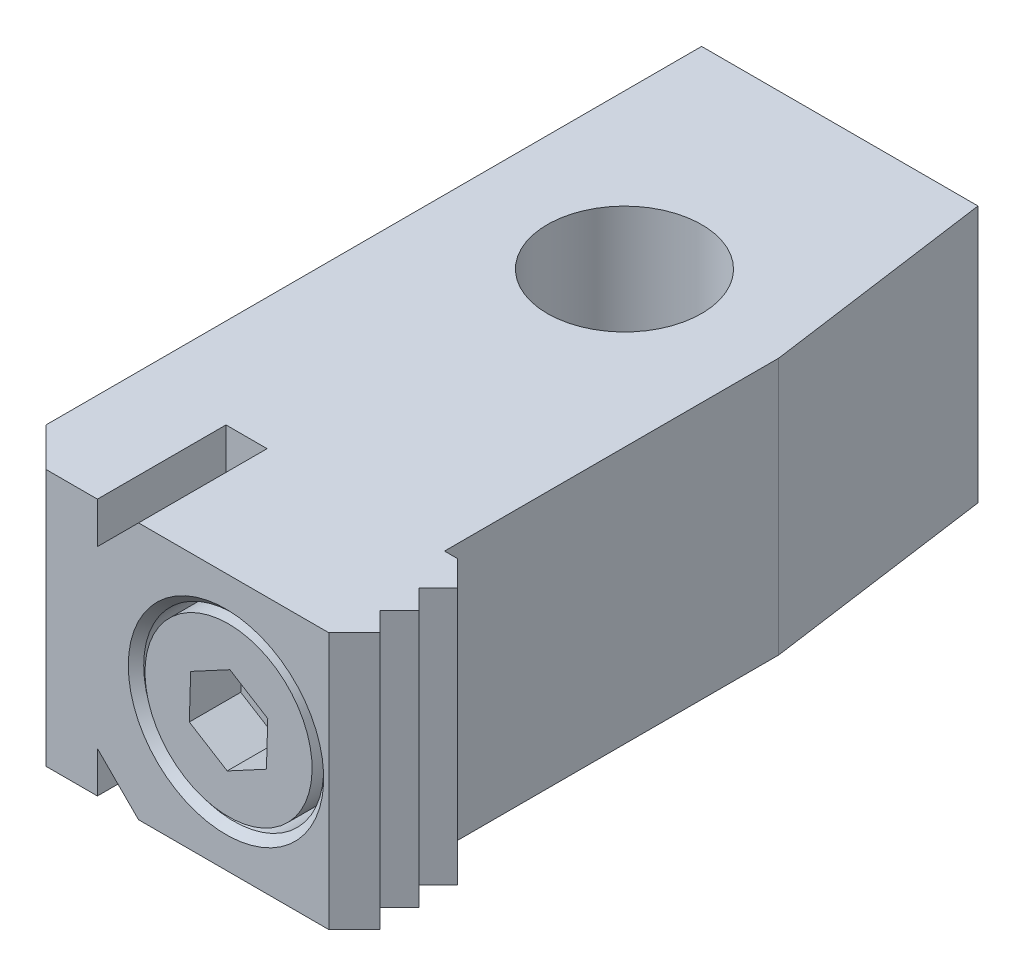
ISO-10303-21;
HEADER;
FILE_DESCRIPTION(('STEP AP214'),'2;1');
FILE_NAME('part.step','',(''),(''),'','','');
FILE_SCHEMA(('AUTOMOTIVE_DESIGN { 1 0 10303 214 1 1 1 1 }'));
ENDSEC;
DATA;
#1=APPLICATION_CONTEXT('core data for automotive mechanical design processes');
#2=APPLICATION_PROTOCOL_DEFINITION('international standard','automotive_design',2000,#1);
#3=PRODUCT_CONTEXT('',#1,'mechanical');
#4=PRODUCT('Part','Part','',(#3));
#5=PRODUCT_RELATED_PRODUCT_CATEGORY('part','',(#4));
#6=PRODUCT_DEFINITION_FORMATION('','',#4);
#7=PRODUCT_DEFINITION_CONTEXT('part definition',#1,'design');
#8=PRODUCT_DEFINITION('design','',#6,#7);
#9=PRODUCT_DEFINITION_SHAPE('','',#8);
#10=(LENGTH_UNIT() NAMED_UNIT(*) SI_UNIT(.MILLI.,.METRE.));
#11=(NAMED_UNIT(*) PLANE_ANGLE_UNIT() SI_UNIT($,.RADIAN.));
#12=(NAMED_UNIT(*) SI_UNIT($,.STERADIAN.) SOLID_ANGLE_UNIT());
#13=UNCERTAINTY_MEASURE_WITH_UNIT(LENGTH_MEASURE(1.E-05),#10,'distance_accuracy_value','');
#14=(GEOMETRIC_REPRESENTATION_CONTEXT(3) GLOBAL_UNCERTAINTY_ASSIGNED_CONTEXT((#13)) GLOBAL_UNIT_ASSIGNED_CONTEXT((#10,
#11,#12)) REPRESENTATION_CONTEXT('',''));
#15=CARTESIAN_POINT('',(0.,0.,0.));
#16=DIRECTION('',(0.,0.,1.));
#17=DIRECTION('',(1.,0.,0.));
#18=AXIS2_PLACEMENT_3D('',#15,#16,#17);
#19=CARTESIAN_POINT('',(-2.,0.,30.8));
#20=DIRECTION('',(0.,0.,-1.));
#21=DIRECTION('',(1.,0.,0.));
#22=AXIS2_PLACEMENT_3D('',#19,#20,#21);
#23=PLANE('',#22);
#24=CARTESIAN_POINT('',(5.,0.,30.8));
#25=DIRECTION('',(0.,0.,1.));
#26=DIRECTION('',(-1.,0.,0.));
#27=AXIS2_PLACEMENT_3D('',#24,#25,#26);
#28=CIRCLE('',#27,7.);
#29=CARTESIAN_POINT('',(-2.,0.,30.8));
#30=VERTEX_POINT('',#29);
#31=EDGE_CURVE('E209',#30,#30,#28,.T.);
#32=ORIENTED_EDGE('',*,*,#31,.T.);
#33=EDGE_LOOP('',(#32));
#34=FACE_BOUND('',#33,.T.);
#35=CARTESIAN_POINT('',(5.,0.,30.8));
#36=DIRECTION('',(0.,0.,-1.));
#37=DIRECTION('',(-0.999547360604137,0.0300844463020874,0.));
#38=AXIS2_PLACEMENT_3D('',#35,#36,#37);
#39=CIRCLE('',#38,6.5);
#40=CARTESIAN_POINT('',(-1.49705784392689,0.195548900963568,30.8));
#41=VERTEX_POINT('',#40);
#42=EDGE_CURVE('E803',#41,#41,#39,.T.);
#43=ORIENTED_EDGE('',*,*,#42,.T.);
#44=EDGE_LOOP('',(#43));
#45=FACE_BOUND('',#44,.T.);
#46=ADVANCED_FACE('F15',(#34,#45),#23,.F.);
#47=CARTESIAN_POINT('',(5.,0.,36.));
#48=DIRECTION('',(0.,0.,1.));
#49=DIRECTION('',(-1.,0.,0.));
#50=AXIS2_PLACEMENT_3D('',#47,#48,#49);
#51=CYLINDRICAL_SURFACE('',#50,7.);
#52=ORIENTED_EDGE('',*,*,#31,.F.);
#53=EDGE_LOOP('',(#52));
#54=FACE_BOUND('',#53,.T.);
#55=CARTESIAN_POINT('',(5.,0.,35.399999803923));
#56=DIRECTION('',(0.,0.,1.));
#57=DIRECTION('',(-1.,0.,0.));
#58=AXIS2_PLACEMENT_3D('',#55,#56,#57);
#59=CIRCLE('',#58,7.);
#60=CARTESIAN_POINT('',(-2.,0.,35.399999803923));
#61=VERTEX_POINT('',#60);
#62=EDGE_CURVE('E215',#61,#61,#59,.T.);
#63=ORIENTED_EDGE('',*,*,#62,.T.);
#64=EDGE_LOOP('',(#63));
#65=FACE_BOUND('',#64,.T.);
#66=ADVANCED_FACE('F565',(#54,#65),#51,.F.);
#67=CARTESIAN_POINT('',(5.,0.,36.));
#68=DIRECTION('',(0.,0.,1.));
#69=DIRECTION('',(-1.,0.,0.));
#70=AXIS2_PLACEMENT_3D('',#67,#68,#69);
#71=CONICAL_SURFACE('',#70,7.6,0.785398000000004);
#72=ORIENTED_EDGE('',*,*,#62,.F.);
#73=EDGE_LOOP('',(#72));
#74=FACE_BOUND('',#73,.T.);
#75=CARTESIAN_POINT('',(5.,0.,36.));
#76=DIRECTION('',(0.,0.,1.));
#77=DIRECTION('',(-1.,0.,0.));
#78=AXIS2_PLACEMENT_3D('',#75,#76,#77);
#79=CIRCLE('',#78,7.6);
#80=CARTESIAN_POINT('',(-2.6,0.,36.));
#81=VERTEX_POINT('',#80);
#82=EDGE_CURVE('E218',#81,#81,#79,.T.);
#83=ORIENTED_EDGE('',*,*,#82,.T.);
#84=EDGE_LOOP('',(#83));
#85=FACE_BOUND('',#84,.T.);
#86=ADVANCED_FACE('F440',(#74,#85),#71,.F.);
#87=CARTESIAN_POINT('',(15.,10.,36.));
#88=DIRECTION('',(0.,0.,1.));
#89=DIRECTION('',(-1.,0.,0.));
#90=AXIS2_PLACEMENT_3D('',#87,#88,#89);
#91=PLANE('',#90);
#92=ORIENTED_EDGE('',*,*,#82,.F.);
#93=EDGE_LOOP('',(#92));
#94=FACE_BOUND('',#93,.T.);
#95=DIRECTION('',(0.,1.,0.));
#96=VECTOR('',#95,1.);
#97=CARTESIAN_POINT('',(13.,-10.,36.));
#98=LINE('',#97,#96);
#99=CARTESIAN_POINT('',(13.,-10.,36.));
#100=VERTEX_POINT('',#99);
#101=CARTESIAN_POINT('',(13.,10.,36.));
#102=VERTEX_POINT('',#101);
#103=EDGE_CURVE('E256',#100,#102,#98,.T.);
#104=ORIENTED_EDGE('',*,*,#103,.T.);
#105=DIRECTION('',(-1.,0.,0.));
#106=VECTOR('',#105,1.);
#107=CARTESIAN_POINT('',(15.,10.,36.));
#108=LINE('',#107,#106);
#109=CARTESIAN_POINT('',(-1.8,10.,36.));
#110=VERTEX_POINT('',#109);
#111=EDGE_CURVE('E280',#102,#110,#108,.T.);
#112=ORIENTED_EDGE('',*,*,#111,.T.);
#113=DIRECTION('',(-0.707106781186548,-0.707106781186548,0.));
#114=VECTOR('',#113,1.);
#115=CARTESIAN_POINT('',(-5.,6.8,36.));
#116=LINE('',#115,#114);
#117=CARTESIAN_POINT('',(-5.,6.8,36.));
#118=VERTEX_POINT('',#117);
#119=EDGE_CURVE('E282',#110,#118,#116,.T.);
#120=ORIENTED_EDGE('',*,*,#119,.T.);
#121=DIRECTION('',(0.,-1.,0.));
#122=VECTOR('',#121,1.);
#123=CARTESIAN_POINT('',(-5.,-10.,36.));
#124=LINE('',#123,#122);
#125=CARTESIAN_POINT('',(-5.,10.,36.));
#126=VERTEX_POINT('',#125);
#127=EDGE_CURVE('E311',#126,#118,#124,.T.);
#128=ORIENTED_EDGE('',*,*,#127,.F.);
#129=DIRECTION('',(-1.,0.,0.));
#130=VECTOR('',#129,1.);
#131=CARTESIAN_POINT('',(12.,10.,36.));
#132=LINE('',#131,#130);
#133=CARTESIAN_POINT('',(-9.,10.,36.));
#134=VERTEX_POINT('',#133);
#135=EDGE_CURVE('E339',#126,#134,#132,.T.);
#136=ORIENTED_EDGE('',*,*,#135,.T.);
#137=DIRECTION('',(0.,-1.,0.));
#138=VECTOR('',#137,1.);
#139=CARTESIAN_POINT('',(-9.,-10.,36.));
#140=LINE('',#139,#138);
#141=CARTESIAN_POINT('',(-9.,-10.,36.));
#142=VERTEX_POINT('',#141);
#143=EDGE_CURVE('E155',#134,#142,#140,.T.);
#144=ORIENTED_EDGE('',*,*,#143,.T.);
#145=DIRECTION('',(-1.,0.,0.));
#146=VECTOR('',#145,1.);
#147=CARTESIAN_POINT('',(12.,-10.,36.));
#148=LINE('',#147,#146);
#149=CARTESIAN_POINT('',(-5.,-10.,36.));
#150=VERTEX_POINT('',#149);
#151=EDGE_CURVE('E194',#150,#142,#148,.T.);
#152=ORIENTED_EDGE('',*,*,#151,.F.);
#153=CARTESIAN_POINT('',(-5.,-6.8,36.));
#154=VERTEX_POINT('',#153);
#155=EDGE_CURVE('E182',#154,#150,#124,.T.);
#156=ORIENTED_EDGE('',*,*,#155,.F.);
#157=DIRECTION('',(0.707106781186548,-0.707106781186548,0.));
#158=VECTOR('',#157,1.);
#159=CARTESIAN_POINT('',(-1.8,-10.,36.));
#160=LINE('',#159,#158);
#161=CARTESIAN_POINT('',(-1.8,-10.,36.));
#162=VERTEX_POINT('',#161);
#163=EDGE_CURVE('E285',#154,#162,#160,.T.);
#164=ORIENTED_EDGE('',*,*,#163,.T.);
#165=DIRECTION('',(1.,0.,0.));
#166=VECTOR('',#165,1.);
#167=CARTESIAN_POINT('',(15.,-10.,36.));
#168=LINE('',#167,#166);
#169=EDGE_CURVE('E287',#162,#100,#168,.T.);
#170=ORIENTED_EDGE('',*,*,#169,.T.);
#171=EDGE_LOOP('',(#104,#112,#120,#128,#136,#144,#152,#156,#164,#170));
#172=FACE_BOUND('',#171,.T.);
#173=ADVANCED_FACE('F389',(#94,#172),#91,.T.);
#174=CARTESIAN_POINT('',(15.,-10.,34.));
#175=DIRECTION('',(-0.707106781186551,0.,-0.707106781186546));
#176=DIRECTION('',(0.707106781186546,0.,-0.707106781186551));
#177=AXIS2_PLACEMENT_3D('',#174,#175,#176);
#178=PLANE('',#177);
#179=DIRECTION('',(-0.707106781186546,0.,0.707106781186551));
#180=VECTOR('',#179,1.);
#181=CARTESIAN_POINT('',(15.,10.,34.));
#182=LINE('',#181,#180);
#183=CARTESIAN_POINT('',(15.,10.,34.));
#184=VERTEX_POINT('',#183);
#185=EDGE_CURVE('E236',#184,#102,#182,.T.);
#186=ORIENTED_EDGE('',*,*,#185,.T.);
#187=ORIENTED_EDGE('',*,*,#103,.F.);
#188=DIRECTION('',(-0.707106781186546,0.,0.707106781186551));
#189=VECTOR('',#188,1.);
#190=CARTESIAN_POINT('',(15.,-10.,34.));
#191=LINE('',#190,#189);
#192=CARTESIAN_POINT('',(15.,-10.,34.));
#193=VERTEX_POINT('',#192);
#194=EDGE_CURVE('E252',#193,#100,#191,.T.);
#195=ORIENTED_EDGE('',*,*,#194,.F.);
#196=DIRECTION('',(0.,1.,0.));
#197=VECTOR('',#196,1.);
#198=CARTESIAN_POINT('',(15.,-10.,34.));
#199=LINE('',#198,#197);
#200=EDGE_CURVE('E260',#193,#184,#199,.T.);
#201=ORIENTED_EDGE('',*,*,#200,.T.);
#202=EDGE_LOOP('',(#186,#187,#195,#201));
#203=FACE_BOUND('',#202,.T.);
#204=ADVANCED_FACE('F431',(#203),#178,.F.);
#205=CARTESIAN_POINT('',(15.,10.,36.));
#206=DIRECTION('',(0.,-1.,0.));
#207=DIRECTION('',(0.,0.,1.));
#208=AXIS2_PLACEMENT_3D('',#205,#206,#207);
#209=PLANE('',#208);
#210=ORIENTED_EDGE('',*,*,#111,.F.);
#211=ORIENTED_EDGE('',*,*,#185,.F.);
#212=DIRECTION('',(0.707106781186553,0.,0.707106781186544));
#213=VECTOR('',#212,1.);
#214=CARTESIAN_POINT('',(13.5,10.,32.5));
#215=LINE('',#214,#213);
#216=CARTESIAN_POINT('',(13.5,10.,32.5));
#217=VERTEX_POINT('',#216);
#218=EDGE_CURVE('E233',#217,#184,#215,.T.);
#219=ORIENTED_EDGE('',*,*,#218,.F.);
#220=DIRECTION('',(-0.707106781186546,0.,0.70710678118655));
#221=VECTOR('',#220,1.);
#222=CARTESIAN_POINT('',(15.,10.,31.));
#223=LINE('',#222,#221);
#224=CARTESIAN_POINT('',(15.,10.,31.));
#225=VERTEX_POINT('',#224);
#226=EDGE_CURVE('E230',#225,#217,#223,.T.);
#227=ORIENTED_EDGE('',*,*,#226,.F.);
#228=DIRECTION('',(0.707106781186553,0.,0.707106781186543));
#229=VECTOR('',#228,1.);
#230=CARTESIAN_POINT('',(13.5,10.,29.5));
#231=LINE('',#230,#229);
#232=CARTESIAN_POINT('',(13.5,10.,29.5));
#233=VERTEX_POINT('',#232);
#234=EDGE_CURVE('E227',#233,#225,#231,.T.);
#235=ORIENTED_EDGE('',*,*,#234,.F.);
#236=DIRECTION('',(-0.707106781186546,0.,0.70710678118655));
#237=VECTOR('',#236,1.);
#238=CARTESIAN_POINT('',(15.,10.,28.));
#239=LINE('',#238,#237);
#240=CARTESIAN_POINT('',(15.,10.,28.));
#241=VERTEX_POINT('',#240);
#242=EDGE_CURVE('E224',#241,#233,#239,.T.);
#243=ORIENTED_EDGE('',*,*,#242,.F.);
#244=DIRECTION('',(0.707106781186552,0.,0.707106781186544));
#245=VECTOR('',#244,1.);
#246=CARTESIAN_POINT('',(13.,10.,26.));
#247=LINE('',#246,#245);
#248=CARTESIAN_POINT('',(13.,10.,26.));
#249=VERTEX_POINT('',#248);
#250=EDGE_CURVE('E221',#249,#241,#247,.T.);
#251=ORIENTED_EDGE('',*,*,#250,.F.);
#252=DIRECTION('',(-1.,0.,0.));
#253=VECTOR('',#252,1.);
#254=CARTESIAN_POINT('',(15.,10.,26.));
#255=LINE('',#254,#253);
#256=CARTESIAN_POINT('',(12.,10.,26.));
#257=VERTEX_POINT('',#256);
#258=EDGE_CURVE('E259',#249,#257,#255,.T.);
#259=ORIENTED_EDGE('',*,*,#258,.T.);
#260=DIRECTION('',(0.,0.,1.));
#261=VECTOR('',#260,1.);
#262=CARTESIAN_POINT('',(12.,10.,-18.));
#263=LINE('',#262,#261);
#264=CARTESIAN_POINT('',(12.,10.,0.));
#265=VERTEX_POINT('',#264);
#266=EDGE_CURVE('E336',#265,#257,#263,.T.);
#267=ORIENTED_EDGE('',*,*,#266,.F.);
#268=DIRECTION('',(-0.137568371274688,0.,-0.990492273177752));
#269=VECTOR('',#268,1.);
#270=CARTESIAN_POINT('',(9.5,10.,-18.));
#271=LINE('',#270,#269);
#272=CARTESIAN_POINT('',(9.5,10.,-18.));
#273=VERTEX_POINT('',#272);
#274=EDGE_CURVE('E171',#265,#273,#271,.T.);
#275=ORIENTED_EDGE('',*,*,#274,.T.);
#276=DIRECTION('',(1.,0.,0.));
#277=VECTOR('',#276,1.);
#278=CARTESIAN_POINT('',(12.,10.,-18.));
#279=LINE('',#278,#277);
#280=CARTESIAN_POINT('',(-12.,10.,-18.));
#281=VERTEX_POINT('',#280);
#282=EDGE_CURVE('E181',#281,#273,#279,.T.);
#283=ORIENTED_EDGE('',*,*,#282,.F.);
#284=DIRECTION('',(0.,0.,-1.));
#285=VECTOR('',#284,1.);
#286=CARTESIAN_POINT('',(-12.,10.,-18.));
#287=LINE('',#286,#285);
#288=CARTESIAN_POINT('',(-12.,10.,33.));
#289=VERTEX_POINT('',#288);
#290=EDGE_CURVE('E341',#289,#281,#287,.T.);
#291=ORIENTED_EDGE('',*,*,#290,.F.);
#292=DIRECTION('',(-0.707106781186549,0.,-0.707106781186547));
#293=VECTOR('',#292,1.);
#294=CARTESIAN_POINT('',(-12.,10.,33.));
#295=LINE('',#294,#293);
#296=EDGE_CURVE('E200',#289,#134,#295,.F.);
#297=ORIENTED_EDGE('',*,*,#296,.T.);
#298=ORIENTED_EDGE('',*,*,#135,.F.);
#299=DIRECTION('',(0.,0.,1.));
#300=VECTOR('',#299,1.);
#301=CARTESIAN_POINT('',(-5.,10.,26.));
#302=LINE('',#301,#300);
#303=CARTESIAN_POINT('',(-5.,10.,26.));
#304=VERTEX_POINT('',#303);
#305=EDGE_CURVE('E325',#304,#126,#302,.T.);
#306=ORIENTED_EDGE('',*,*,#305,.F.);
#307=DIRECTION('',(-1.,0.,0.));
#308=VECTOR('',#307,1.);
#309=CARTESIAN_POINT('',(12.,10.,26.));
#310=LINE('',#309,#308);
#311=CARTESIAN_POINT('',(-1.8,10.,26.));
#312=VERTEX_POINT('',#311);
#313=EDGE_CURVE('E314',#312,#304,#310,.T.);
#314=ORIENTED_EDGE('',*,*,#313,.F.);
#315=DIRECTION('',(0.,0.,-1.));
#316=VECTOR('',#315,1.);
#317=CARTESIAN_POINT('',(-1.8,10.,36.));
#318=LINE('',#317,#316);
#319=EDGE_CURVE('E297',#110,#312,#318,.T.);
#320=ORIENTED_EDGE('',*,*,#319,.F.);
#321=EDGE_LOOP('',(#210,#211,#219,#227,#235,#243,#251,#259,#267,#275,#283,#291,#297,#298,#306,
#314,#320));
#322=FACE_BOUND('',#321,.T.);
#323=CARTESIAN_POINT('',(0.,10.,0.));
#324=DIRECTION('',(0.,-1.,0.));
#325=DIRECTION('',(0.,0.,1.));
#326=AXIS2_PLACEMENT_3D('',#323,#324,#325);
#327=CIRCLE('',#326,6.);
#328=CARTESIAN_POINT('',(0.,10.,6.));
#329=VERTEX_POINT('',#328);
#330=EDGE_CURVE('E329',#329,#329,#327,.T.);
#331=ORIENTED_EDGE('',*,*,#330,.T.);
#332=EDGE_LOOP('',(#331));
#333=FACE_BOUND('',#332,.T.);
#334=ADVANCED_FACE('F356',(#322,#333),#209,.F.);
#335=CARTESIAN_POINT('',(-5.,6.8,36.));
#336=DIRECTION('',(0.707106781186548,-0.707106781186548,0.));
#337=DIRECTION('',(0.707106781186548,0.707106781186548,0.));
#338=AXIS2_PLACEMENT_3D('',#335,#336,#337);
#339=PLANE('',#338);
#340=DIRECTION('',(-0.707106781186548,-0.707106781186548,0.));
#341=VECTOR('',#340,1.);
#342=CARTESIAN_POINT('',(-5.,6.8,26.));
#343=LINE('',#342,#341);
#344=CARTESIAN_POINT('',(-5.,6.8,26.));
#345=VERTEX_POINT('',#344);
#346=EDGE_CURVE('E273',#312,#345,#343,.T.);
#347=ORIENTED_EDGE('',*,*,#346,.T.);
#348=DIRECTION('',(0.,0.,-1.));
#349=VECTOR('',#348,1.);
#350=CARTESIAN_POINT('',(-5.,6.8,36.));
#351=LINE('',#350,#349);
#352=EDGE_CURVE('E295',#118,#345,#351,.T.);
#353=ORIENTED_EDGE('',*,*,#352,.F.);
#354=ORIENTED_EDGE('',*,*,#119,.F.);
#355=ORIENTED_EDGE('',*,*,#319,.T.);
#356=EDGE_LOOP('',(#347,#353,#354,#355));
#357=FACE_BOUND('',#356,.T.);
#358=ADVANCED_FACE('F428',(#357),#339,.F.);
#359=CARTESIAN_POINT('',(-1.8,-10.,36.));
#360=DIRECTION('',(0.707106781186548,0.707106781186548,0.));
#361=DIRECTION('',(-0.707106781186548,0.707106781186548,0.));
#362=AXIS2_PLACEMENT_3D('',#359,#360,#361);
#363=PLANE('',#362);
#364=DIRECTION('',(0.707106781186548,-0.707106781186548,0.));
#365=VECTOR('',#364,1.);
#366=CARTESIAN_POINT('',(-1.8,-10.,26.));
#367=LINE('',#366,#365);
#368=CARTESIAN_POINT('',(-5.,-6.8,26.));
#369=VERTEX_POINT('',#368);
#370=CARTESIAN_POINT('',(-1.8,-10.,26.));
#371=VERTEX_POINT('',#370);
#372=EDGE_CURVE('E276',#369,#371,#367,.T.);
#373=ORIENTED_EDGE('',*,*,#372,.T.);
#374=DIRECTION('',(0.,0.,-1.));
#375=VECTOR('',#374,1.);
#376=CARTESIAN_POINT('',(-1.8,-10.,36.));
#377=LINE('',#376,#375);
#378=EDGE_CURVE('E290',#162,#371,#377,.T.);
#379=ORIENTED_EDGE('',*,*,#378,.F.);
#380=ORIENTED_EDGE('',*,*,#163,.F.);
#381=DIRECTION('',(0.,0.,-1.));
#382=VECTOR('',#381,1.);
#383=CARTESIAN_POINT('',(-5.,-6.8,36.));
#384=LINE('',#383,#382);
#385=EDGE_CURVE('E293',#154,#369,#384,.T.);
#386=ORIENTED_EDGE('',*,*,#385,.T.);
#387=EDGE_LOOP('',(#373,#379,#380,#386));
#388=FACE_BOUND('',#387,.T.);
#389=ADVANCED_FACE('F393',(#388),#363,.F.);
#390=CARTESIAN_POINT('',(15.,-10.,36.));
#391=DIRECTION('',(0.,1.,0.));
#392=DIRECTION('',(0.,0.,-1.));
#393=AXIS2_PLACEMENT_3D('',#390,#391,#392);
#394=PLANE('',#393);
#395=DIRECTION('',(0.707106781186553,0.,0.707106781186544));
#396=VECTOR('',#395,1.);
#397=CARTESIAN_POINT('',(13.5,-10.,32.5));
#398=LINE('',#397,#396);
#399=CARTESIAN_POINT('',(13.5,-10.,32.5));
#400=VERTEX_POINT('',#399);
#401=EDGE_CURVE('E250',#400,#193,#398,.T.);
#402=ORIENTED_EDGE('',*,*,#401,.T.);
#403=ORIENTED_EDGE('',*,*,#194,.T.);
#404=ORIENTED_EDGE('',*,*,#169,.F.);
#405=ORIENTED_EDGE('',*,*,#378,.T.);
#406=DIRECTION('',(1.,0.,0.));
#407=VECTOR('',#406,1.);
#408=CARTESIAN_POINT('',(12.,-10.,26.));
#409=LINE('',#408,#407);
#410=CARTESIAN_POINT('',(-5.,-10.,26.));
#411=VERTEX_POINT('',#410);
#412=EDGE_CURVE('E322',#411,#371,#409,.T.);
#413=ORIENTED_EDGE('',*,*,#412,.F.);
#414=DIRECTION('',(0.,0.,1.));
#415=VECTOR('',#414,1.);
#416=CARTESIAN_POINT('',(-5.,-10.,26.));
#417=LINE('',#416,#415);
#418=EDGE_CURVE('E326',#411,#150,#417,.T.);
#419=ORIENTED_EDGE('',*,*,#418,.T.);
#420=ORIENTED_EDGE('',*,*,#151,.T.);
#421=DIRECTION('',(0.707106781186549,0.,0.707106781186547));
#422=VECTOR('',#421,1.);
#423=CARTESIAN_POINT('',(-25.5,-10.,19.5));
#424=LINE('',#423,#422);
#425=CARTESIAN_POINT('',(-12.,-10.,33.));
#426=VERTEX_POINT('',#425);
#427=EDGE_CURVE('E19',#142,#426,#424,.F.);
#428=ORIENTED_EDGE('',*,*,#427,.T.);
#429=DIRECTION('',(0.,0.,-1.));
#430=VECTOR('',#429,1.);
#431=CARTESIAN_POINT('',(-12.,-10.,-18.));
#432=LINE('',#431,#430);
#433=CARTESIAN_POINT('',(-12.,-10.,-18.));
#434=VERTEX_POINT('',#433);
#435=EDGE_CURVE('E188',#426,#434,#432,.T.);
#436=ORIENTED_EDGE('',*,*,#435,.T.);
#437=DIRECTION('',(1.,0.,0.));
#438=VECTOR('',#437,1.);
#439=CARTESIAN_POINT('',(12.,-10.,-18.));
#440=LINE('',#439,#438);
#441=CARTESIAN_POINT('',(9.5,-10.,-18.));
#442=VERTEX_POINT('',#441);
#443=EDGE_CURVE('E179',#434,#442,#440,.T.);
#444=ORIENTED_EDGE('',*,*,#443,.T.);
#445=DIRECTION('',(-0.137568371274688,0.,-0.990492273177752));
#446=VECTOR('',#445,1.);
#447=CARTESIAN_POINT('',(9.5,-10.,-18.));
#448=LINE('',#447,#446);
#449=CARTESIAN_POINT('',(12.,-10.,0.));
#450=VERTEX_POINT('',#449);
#451=EDGE_CURVE('E160',#450,#442,#448,.T.);
#452=ORIENTED_EDGE('',*,*,#451,.F.);
#453=DIRECTION('',(0.,0.,1.));
#454=VECTOR('',#453,1.);
#455=CARTESIAN_POINT('',(12.,-10.,-18.));
#456=LINE('',#455,#454);
#457=CARTESIAN_POINT('',(12.,-10.,26.));
#458=VERTEX_POINT('',#457);
#459=EDGE_CURVE('E344',#450,#458,#456,.T.);
#460=ORIENTED_EDGE('',*,*,#459,.T.);
#461=DIRECTION('',(1.,0.,0.));
#462=VECTOR('',#461,1.);
#463=CARTESIAN_POINT('',(15.,-10.,26.));
#464=LINE('',#463,#462);
#465=CARTESIAN_POINT('',(13.,-10.,26.));
#466=VERTEX_POINT('',#465);
#467=EDGE_CURVE('E278',#458,#466,#464,.T.);
#468=ORIENTED_EDGE('',*,*,#467,.T.);
#469=DIRECTION('',(0.707106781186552,0.,0.707106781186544));
#470=VECTOR('',#469,1.);
#471=CARTESIAN_POINT('',(13.,-10.,26.));
#472=LINE('',#471,#470);
#473=CARTESIAN_POINT('',(15.,-10.,28.));
#474=VERTEX_POINT('',#473);
#475=EDGE_CURVE('E238',#466,#474,#472,.T.);
#476=ORIENTED_EDGE('',*,*,#475,.T.);
#477=DIRECTION('',(-0.707106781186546,0.,0.70710678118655));
#478=VECTOR('',#477,1.);
#479=CARTESIAN_POINT('',(15.,-10.,28.));
#480=LINE('',#479,#478);
#481=CARTESIAN_POINT('',(13.5,-10.,29.5));
#482=VERTEX_POINT('',#481);
#483=EDGE_CURVE('E241',#474,#482,#480,.T.);
#484=ORIENTED_EDGE('',*,*,#483,.T.);
#485=DIRECTION('',(0.707106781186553,0.,0.707106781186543));
#486=VECTOR('',#485,1.);
#487=CARTESIAN_POINT('',(13.5,-10.,29.5));
#488=LINE('',#487,#486);
#489=CARTESIAN_POINT('',(15.,-10.,31.));
#490=VERTEX_POINT('',#489);
#491=EDGE_CURVE('E244',#482,#490,#488,.T.);
#492=ORIENTED_EDGE('',*,*,#491,.T.);
#493=DIRECTION('',(-0.707106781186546,0.,0.70710678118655));
#494=VECTOR('',#493,1.);
#495=CARTESIAN_POINT('',(15.,-10.,31.));
#496=LINE('',#495,#494);
#497=EDGE_CURVE('E247',#490,#400,#496,.T.);
#498=ORIENTED_EDGE('',*,*,#497,.T.);
#499=EDGE_LOOP('',(#402,#403,#404,#405,#413,#419,#420,#428,#436,#444,#452,#460,#468,#476,#484,
#492,#498));
#500=FACE_BOUND('',#499,.T.);
#501=CARTESIAN_POINT('',(0.,-10.,0.));
#502=DIRECTION('',(0.,-1.,0.));
#503=DIRECTION('',(0.,0.,1.));
#504=AXIS2_PLACEMENT_3D('',#501,#502,#503);
#505=CIRCLE('',#504,6.);
#506=CARTESIAN_POINT('',(0.,-10.,6.));
#507=VERTEX_POINT('',#506);
#508=EDGE_CURVE('E333',#507,#507,#505,.T.);
#509=ORIENTED_EDGE('',*,*,#508,.F.);
#510=EDGE_LOOP('',(#509));
#511=FACE_BOUND('',#510,.T.);
#512=ADVANCED_FACE('F185',(#500,#511),#394,.F.);
#513=CARTESIAN_POINT('',(13.5,-10.,32.5));
#514=DIRECTION('',(-0.707106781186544,0.,0.707106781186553));
#515=DIRECTION('',(-0.707106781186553,0.,-0.707106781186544));
#516=AXIS2_PLACEMENT_3D('',#513,#514,#515);
#517=PLANE('',#516);
#518=ORIENTED_EDGE('',*,*,#218,.T.);
#519=ORIENTED_EDGE('',*,*,#200,.F.);
#520=ORIENTED_EDGE('',*,*,#401,.F.);
#521=DIRECTION('',(0.,1.,0.));
#522=VECTOR('',#521,1.);
#523=CARTESIAN_POINT('',(13.5,-10.,32.5));
#524=LINE('',#523,#522);
#525=EDGE_CURVE('E262',#400,#217,#524,.T.);
#526=ORIENTED_EDGE('',*,*,#525,.T.);
#527=EDGE_LOOP('',(#518,#519,#520,#526));
#528=FACE_BOUND('',#527,.T.);
#529=ADVANCED_FACE('F385',(#528),#517,.F.);
#530=CARTESIAN_POINT('',(15.,-10.,31.));
#531=DIRECTION('',(-0.707106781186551,0.,-0.707106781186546));
#532=DIRECTION('',(0.707106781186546,0.,-0.707106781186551));
#533=AXIS2_PLACEMENT_3D('',#530,#531,#532);
#534=PLANE('',#533);
#535=ORIENTED_EDGE('',*,*,#226,.T.);
#536=ORIENTED_EDGE('',*,*,#525,.F.);
#537=ORIENTED_EDGE('',*,*,#497,.F.);
#538=DIRECTION('',(0.,1.,0.));
#539=VECTOR('',#538,1.);
#540=CARTESIAN_POINT('',(15.,-10.,31.));
#541=LINE('',#540,#539);
#542=EDGE_CURVE('E264',#490,#225,#541,.T.);
#543=ORIENTED_EDGE('',*,*,#542,.T.);
#544=EDGE_LOOP('',(#535,#536,#537,#543));
#545=FACE_BOUND('',#544,.T.);
#546=ADVANCED_FACE('F381',(#545),#534,.F.);
#547=CARTESIAN_POINT('',(13.5,-10.,29.5));
#548=DIRECTION('',(-0.707106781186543,0.,0.707106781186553));
#549=DIRECTION('',(-0.707106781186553,0.,-0.707106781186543));
#550=AXIS2_PLACEMENT_3D('',#547,#548,#549);
#551=PLANE('',#550);
#552=ORIENTED_EDGE('',*,*,#234,.T.);
#553=ORIENTED_EDGE('',*,*,#542,.F.);
#554=ORIENTED_EDGE('',*,*,#491,.F.);
#555=DIRECTION('',(0.,1.,0.));
#556=VECTOR('',#555,1.);
#557=CARTESIAN_POINT('',(13.5,-10.,29.5));
#558=LINE('',#557,#556);
#559=EDGE_CURVE('E266',#482,#233,#558,.T.);
#560=ORIENTED_EDGE('',*,*,#559,.T.);
#561=EDGE_LOOP('',(#552,#553,#554,#560));
#562=FACE_BOUND('',#561,.T.);
#563=ADVANCED_FACE('F379',(#562),#551,.F.);
#564=CARTESIAN_POINT('',(15.,-10.,28.));
#565=DIRECTION('',(-0.70710678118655,0.,-0.707106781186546));
#566=DIRECTION('',(0.707106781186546,0.,-0.70710678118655));
#567=AXIS2_PLACEMENT_3D('',#564,#565,#566);
#568=PLANE('',#567);
#569=ORIENTED_EDGE('',*,*,#242,.T.);
#570=ORIENTED_EDGE('',*,*,#559,.F.);
#571=ORIENTED_EDGE('',*,*,#483,.F.);
#572=DIRECTION('',(0.,1.,0.));
#573=VECTOR('',#572,1.);
#574=CARTESIAN_POINT('',(15.,-10.,28.));
#575=LINE('',#574,#573);
#576=EDGE_CURVE('E268',#474,#241,#575,.T.);
#577=ORIENTED_EDGE('',*,*,#576,.T.);
#578=EDGE_LOOP('',(#569,#570,#571,#577));
#579=FACE_BOUND('',#578,.T.);
#580=ADVANCED_FACE('F374',(#579),#568,.F.);
#581=CARTESIAN_POINT('',(13.,-10.,26.));
#582=DIRECTION('',(-0.707106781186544,0.,0.707106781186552));
#583=DIRECTION('',(-0.707106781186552,0.,-0.707106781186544));
#584=AXIS2_PLACEMENT_3D('',#581,#582,#583);
#585=PLANE('',#584);
#586=ORIENTED_EDGE('',*,*,#250,.T.);
#587=ORIENTED_EDGE('',*,*,#576,.F.);
#588=ORIENTED_EDGE('',*,*,#475,.F.);
#589=DIRECTION('',(0.,1.,0.));
#590=VECTOR('',#589,1.);
#591=CARTESIAN_POINT('',(13.,-10.,26.));
#592=LINE('',#591,#590);
#593=EDGE_CURVE('E255',#466,#249,#592,.T.);
#594=ORIENTED_EDGE('',*,*,#593,.T.);
#595=EDGE_LOOP('',(#586,#587,#588,#594));
#596=FACE_BOUND('',#595,.T.);
#597=ADVANCED_FACE('F369',(#596),#585,.F.);
#598=CARTESIAN_POINT('',(15.,10.,26.));
#599=DIRECTION('',(0.,0.,1.));
#600=DIRECTION('',(-1.,0.,0.));
#601=AXIS2_PLACEMENT_3D('',#598,#599,#600);
#602=PLANE('',#601);
#603=ORIENTED_EDGE('',*,*,#467,.F.);
#604=DIRECTION('',(0.,1.,0.));
#605=VECTOR('',#604,1.);
#606=CARTESIAN_POINT('',(12.,-10.,26.));
#607=LINE('',#606,#605);
#608=EDGE_CURVE('E300',#458,#257,#607,.T.);
#609=ORIENTED_EDGE('',*,*,#608,.T.);
#610=ORIENTED_EDGE('',*,*,#258,.F.);
#611=ORIENTED_EDGE('',*,*,#593,.F.);
#612=EDGE_LOOP('',(#603,#609,#610,#611));
#613=FACE_BOUND('',#612,.T.);
#614=ADVANCED_FACE('F365',(#613),#602,.F.);
#615=CARTESIAN_POINT('',(12.,-10.,26.));
#616=DIRECTION('',(0.,0.,1.));
#617=DIRECTION('',(-1.,0.,0.));
#618=AXIS2_PLACEMENT_3D('',#615,#616,#617);
#619=PLANE('',#618);
#620=ORIENTED_EDGE('',*,*,#346,.F.);
#621=ORIENTED_EDGE('',*,*,#313,.T.);
#622=DIRECTION('',(0.,-1.,0.));
#623=VECTOR('',#622,1.);
#624=CARTESIAN_POINT('',(-5.,-10.,26.));
#625=LINE('',#624,#623);
#626=EDGE_CURVE('E319',#304,#345,#625,.T.);
#627=ORIENTED_EDGE('',*,*,#626,.T.);
#628=EDGE_LOOP('',(#620,#621,#627));
#629=FACE_BOUND('',#628,.T.);
#630=ADVANCED_FACE('F410',(#629),#619,.T.);
#631=CARTESIAN_POINT('',(-5.,-10.,26.));
#632=DIRECTION('',(-1.,0.,0.));
#633=DIRECTION('',(0.,-1.,0.));
#634=AXIS2_PLACEMENT_3D('',#631,#632,#633);
#635=PLANE('',#634);
#636=ORIENTED_EDGE('',*,*,#127,.T.);
#637=ORIENTED_EDGE('',*,*,#352,.T.);
#638=ORIENTED_EDGE('',*,*,#626,.F.);
#639=ORIENTED_EDGE('',*,*,#305,.T.);
#640=EDGE_LOOP('',(#636,#637,#638,#639));
#641=FACE_BOUND('',#640,.T.);
#642=ADVANCED_FACE('F402',(#641),#635,.F.);
#643=CARTESIAN_POINT('',(-12.,-10.,33.));
#644=DIRECTION('',(0.707106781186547,0.,-0.707106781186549));
#645=DIRECTION('',(0.707106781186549,0.,0.707106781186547));
#646=AXIS2_PLACEMENT_3D('',#643,#644,#645);
#647=PLANE('',#646);
#648=ORIENTED_EDGE('',*,*,#427,.F.);
#649=ORIENTED_EDGE('',*,*,#143,.F.);
#650=ORIENTED_EDGE('',*,*,#296,.F.);
#651=DIRECTION('',(0.,1.,0.));
#652=VECTOR('',#651,1.);
#653=CARTESIAN_POINT('',(-12.,-10.,33.));
#654=LINE('',#653,#652);
#655=EDGE_CURVE('E192',#426,#289,#654,.T.);
#656=ORIENTED_EDGE('',*,*,#655,.F.);
#657=EDGE_LOOP('',(#648,#649,#650,#656));
#658=FACE_BOUND('',#657,.T.);
#659=ADVANCED_FACE('F350',(#658),#647,.F.);
#660=EDGE_CURVE('E318',#369,#411,#625,.T.);
#661=ORIENTED_EDGE('',*,*,#660,.F.);
#662=ORIENTED_EDGE('',*,*,#385,.F.);
#663=ORIENTED_EDGE('',*,*,#155,.T.);
#664=ORIENTED_EDGE('',*,*,#418,.F.);
#665=EDGE_LOOP('',(#661,#662,#663,#664));
#666=FACE_BOUND('',#665,.T.);
#667=ADVANCED_FACE('F399',(#666),#635,.F.);
#668=ORIENTED_EDGE('',*,*,#372,.F.);
#669=ORIENTED_EDGE('',*,*,#660,.T.);
#670=ORIENTED_EDGE('',*,*,#412,.T.);
#671=EDGE_LOOP('',(#668,#669,#670));
#672=FACE_BOUND('',#671,.T.);
#673=ADVANCED_FACE('F396',(#672),#619,.T.);
#674=CARTESIAN_POINT('',(12.,-10.,-18.));
#675=DIRECTION('',(-1.,0.,0.));
#676=DIRECTION('',(0.,0.,-1.));
#677=AXIS2_PLACEMENT_3D('',#674,#675,#676);
#678=PLANE('',#677);
#679=ORIENTED_EDGE('',*,*,#459,.F.);
#680=DIRECTION('',(0.,-1.,0.));
#681=VECTOR('',#680,1.);
#682=CARTESIAN_POINT('',(12.,10.,0.));
#683=LINE('',#682,#681);
#684=EDGE_CURVE('E166',#265,#450,#683,.T.);
#685=ORIENTED_EDGE('',*,*,#684,.F.);
#686=ORIENTED_EDGE('',*,*,#266,.T.);
#687=ORIENTED_EDGE('',*,*,#608,.F.);
#688=EDGE_LOOP('',(#679,#685,#686,#687));
#689=FACE_BOUND('',#688,.T.);
#690=ADVANCED_FACE('F17',(#689),#678,.F.);
#691=CARTESIAN_POINT('',(9.5,10.,-18.));
#692=DIRECTION('',(-0.990492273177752,0.,0.137568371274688));
#693=DIRECTION('',(-0.137568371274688,0.,-0.990492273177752));
#694=AXIS2_PLACEMENT_3D('',#691,#692,#693);
#695=PLANE('',#694);
#696=ORIENTED_EDGE('',*,*,#451,.T.);
#697=DIRECTION('',(0.,-1.,0.));
#698=VECTOR('',#697,1.);
#699=CARTESIAN_POINT('',(9.5,10.,-18.));
#700=LINE('',#699,#698);
#701=EDGE_CURVE('E163',#273,#442,#700,.T.);
#702=ORIENTED_EDGE('',*,*,#701,.F.);
#703=ORIENTED_EDGE('',*,*,#274,.F.);
#704=ORIENTED_EDGE('',*,*,#684,.T.);
#705=EDGE_LOOP('',(#696,#702,#703,#704));
#706=FACE_BOUND('',#705,.T.);
#707=ADVANCED_FACE('F162',(#706),#695,.F.);
#708=CARTESIAN_POINT('',(12.,-10.,-18.));
#709=DIRECTION('',(0.,0.,1.));
#710=DIRECTION('',(-1.,0.,0.));
#711=AXIS2_PLACEMENT_3D('',#708,#709,#710);
#712=PLANE('',#711);
#713=ORIENTED_EDGE('',*,*,#282,.T.);
#714=ORIENTED_EDGE('',*,*,#701,.T.);
#715=ORIENTED_EDGE('',*,*,#443,.F.);
#716=DIRECTION('',(0.,1.,0.));
#717=VECTOR('',#716,1.);
#718=CARTESIAN_POINT('',(-12.,-10.,-18.));
#719=LINE('',#718,#717);
#720=EDGE_CURVE('E190',#434,#281,#719,.T.);
#721=ORIENTED_EDGE('',*,*,#720,.T.);
#722=EDGE_LOOP('',(#713,#714,#715,#721));
#723=FACE_BOUND('',#722,.T.);
#724=ADVANCED_FACE('F177',(#723),#712,.F.);
#725=CARTESIAN_POINT('',(-12.,-10.,-18.));
#726=DIRECTION('',(1.,0.,0.));
#727=DIRECTION('',(0.,0.,1.));
#728=AXIS2_PLACEMENT_3D('',#725,#726,#727);
#729=PLANE('',#728);
#730=ORIENTED_EDGE('',*,*,#435,.F.);
#731=ORIENTED_EDGE('',*,*,#655,.T.);
#732=ORIENTED_EDGE('',*,*,#290,.T.);
#733=ORIENTED_EDGE('',*,*,#720,.F.);
#734=EDGE_LOOP('',(#730,#731,#732,#733));
#735=FACE_BOUND('',#734,.T.);
#736=ADVANCED_FACE('F353',(#735),#729,.F.);
#737=CARTESIAN_POINT('',(0.,-10.,0.));
#738=DIRECTION('',(0.,1.,0.));
#739=DIRECTION('',(0.,0.,-1.));
#740=AXIS2_PLACEMENT_3D('',#737,#738,#739);
#741=CYLINDRICAL_SURFACE('',#740,6.);
#742=ORIENTED_EDGE('',*,*,#508,.T.);
#743=EDGE_LOOP('',(#742));
#744=FACE_BOUND('',#743,.T.);
#745=ORIENTED_EDGE('',*,*,#330,.F.);
#746=EDGE_LOOP('',(#745));
#747=FACE_BOUND('',#746,.T.);
#748=ADVANCED_FACE('F413',(#744,#747),#741,.F.);
#749=CARTESIAN_POINT('',(5.,0.,35.8));
#750=DIRECTION('',(0.,0.,1.));
#751=DIRECTION('',(0.999547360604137,-0.0300844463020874,0.));
#752=AXIS2_PLACEMENT_3D('',#749,#750,#751);
#753=PLANE('',#752);
#754=CARTESIAN_POINT('',(5.,0.,35.8));
#755=DIRECTION('',(0.,0.,1.));
#756=DIRECTION('',(0.999547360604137,-0.0300844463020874,0.));
#757=AXIS2_PLACEMENT_3D('',#754,#755,#756);
#758=CIRCLE('',#757,6.5);
#759=CARTESIAN_POINT('',(11.4970578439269,-0.195548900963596,35.8));
#760=VERTEX_POINT('',#759);
#761=EDGE_CURVE('E858',#760,#760,#758,.T.);
#762=ORIENTED_EDGE('',*,*,#761,.T.);
#763=EDGE_LOOP('',(#762));
#764=FACE_BOUND('',#763,.T.);
#765=DIRECTION('',(-0.880675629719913,-0.473719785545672,0.));
#766=VECTOR('',#765,1.);
#767=CARTESIAN_POINT('',(5.10421557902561,3.46253362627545,35.8));
#768=LINE('',#767,#766);
#769=CARTESIAN_POINT('',(5.10421557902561,3.46253362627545,35.8));
#770=VERTEX_POINT('',#769);
#771=CARTESIAN_POINT('',(2.05346570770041,1.82152015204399,35.8));
#772=VERTEX_POINT('',#771);
#773=EDGE_CURVE('E808',#770,#772,#768,.T.);
#774=ORIENTED_EDGE('',*,*,#773,.F.);
#775=DIRECTION('',(0.850591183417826,-0.525827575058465,0.));
#776=VECTOR('',#775,1.);
#777=CARTESIAN_POINT('',(5.10421557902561,3.46253362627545,35.8));
#778=LINE('',#777,#776);
#779=CARTESIAN_POINT('',(8.05074987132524,1.64101347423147,35.8));
#780=VERTEX_POINT('',#779);
#781=EDGE_CURVE('E35',#770,#780,#778,.T.);
#782=ORIENTED_EDGE('',*,*,#781,.T.);
#783=DIRECTION('',(0.0300844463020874,0.999547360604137,0.));
#784=VECTOR('',#783,1.);
#785=CARTESIAN_POINT('',(7.94653429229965,-1.82152015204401,35.8));
#786=LINE('',#785,#784);
#787=CARTESIAN_POINT('',(7.94653429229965,-1.82152015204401,35.8));
#788=VERTEX_POINT('',#787);
#789=EDGE_CURVE('E821',#788,#780,#786,.T.);
#790=ORIENTED_EDGE('',*,*,#789,.F.);
#791=DIRECTION('',(0.880675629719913,0.473719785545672,0.));
#792=VECTOR('',#791,1.);
#793=CARTESIAN_POINT('',(4.89578442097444,-3.46253362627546,35.8));
#794=LINE('',#793,#792);
#795=CARTESIAN_POINT('',(4.89578442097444,-3.46253362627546,35.8));
#796=VERTEX_POINT('',#795);
#797=EDGE_CURVE('E818',#796,#788,#794,.T.);
#798=ORIENTED_EDGE('',*,*,#797,.F.);
#799=DIRECTION('',(-0.850591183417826,0.525827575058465,0.));
#800=VECTOR('',#799,1.);
#801=CARTESIAN_POINT('',(4.89578442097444,-3.46253362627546,35.8));
#802=LINE('',#801,#800);
#803=CARTESIAN_POINT('',(1.94925012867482,-1.64101347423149,35.8));
#804=VERTEX_POINT('',#803);
#805=EDGE_CURVE('E815',#796,#804,#802,.T.);
#806=ORIENTED_EDGE('',*,*,#805,.T.);
#807=DIRECTION('',(-0.0300844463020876,-0.999547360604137,0.));
#808=VECTOR('',#807,1.);
#809=CARTESIAN_POINT('',(2.05346570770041,1.82152015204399,35.8));
#810=LINE('',#809,#808);
#811=EDGE_CURVE('E812',#772,#804,#810,.T.);
#812=ORIENTED_EDGE('',*,*,#811,.F.);
#813=EDGE_LOOP('',(#774,#782,#790,#798,#806,#812));
#814=FACE_BOUND('',#813,.T.);
#815=ADVANCED_FACE('F500',(#764,#814),#753,.T.);
#816=CARTESIAN_POINT('',(2.15768128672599,5.28405377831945,31.8));
#817=DIRECTION('',(0.,0.,-1.));
#818=DIRECTION('',(-0.999547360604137,0.0300844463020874,0.));
#819=AXIS2_PLACEMENT_3D('',#816,#817,#818);
#820=PLANE('',#819);
#821=DIRECTION('',(0.850591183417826,-0.525827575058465,0.));
#822=VECTOR('',#821,1.);
#823=CARTESIAN_POINT('',(5.10421557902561,3.46253362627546,31.8));
#824=LINE('',#823,#822);
#825=CARTESIAN_POINT('',(5.10421557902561,3.46253362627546,31.8));
#826=VERTEX_POINT('',#825);
#827=CARTESIAN_POINT('',(8.05074987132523,1.64101347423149,31.8));
#828=VERTEX_POINT('',#827);
#829=EDGE_CURVE('E811',#826,#828,#824,.T.);
#830=ORIENTED_EDGE('',*,*,#829,.F.);
#831=DIRECTION('',(-0.880675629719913,-0.473719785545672,0.));
#832=VECTOR('',#831,1.);
#833=CARTESIAN_POINT('',(5.10421557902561,3.46253362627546,31.8));
#834=LINE('',#833,#832);
#835=CARTESIAN_POINT('',(2.05346570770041,1.82152015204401,31.8));
#836=VERTEX_POINT('',#835);
#837=EDGE_CURVE('E825',#826,#836,#834,.T.);
#838=ORIENTED_EDGE('',*,*,#837,.T.);
#839=DIRECTION('',(-0.0300844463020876,-0.999547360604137,0.));
#840=VECTOR('',#839,1.);
#841=CARTESIAN_POINT('',(2.05346570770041,1.82152015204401,31.8));
#842=LINE('',#841,#840);
#843=CARTESIAN_POINT('',(1.94925012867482,-1.64101347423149,31.8));
#844=VERTEX_POINT('',#843);
#845=EDGE_CURVE('E829',#836,#844,#842,.T.);
#846=ORIENTED_EDGE('',*,*,#845,.T.);
#847=DIRECTION('',(-0.850591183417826,0.525827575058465,0.));
#848=VECTOR('',#847,1.);
#849=CARTESIAN_POINT('',(4.89578442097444,-3.46253362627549,31.8));
#850=LINE('',#849,#848);
#851=CARTESIAN_POINT('',(4.89578442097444,-3.46253362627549,31.8));
#852=VERTEX_POINT('',#851);
#853=EDGE_CURVE('E832',#852,#844,#850,.T.);
#854=ORIENTED_EDGE('',*,*,#853,.F.);
#855=DIRECTION('',(0.880675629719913,0.473719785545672,0.));
#856=VECTOR('',#855,1.);
#857=CARTESIAN_POINT('',(4.89578442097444,-3.46253362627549,31.8));
#858=LINE('',#857,#856);
#859=CARTESIAN_POINT('',(7.94653429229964,-1.82152015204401,31.8));
#860=VERTEX_POINT('',#859);
#861=EDGE_CURVE('E835',#852,#860,#858,.T.);
#862=ORIENTED_EDGE('',*,*,#861,.T.);
#863=DIRECTION('',(0.0300844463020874,0.999547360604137,0.));
#864=VECTOR('',#863,1.);
#865=CARTESIAN_POINT('',(7.94653429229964,-1.82152015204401,31.8));
#866=LINE('',#865,#864);
#867=EDGE_CURVE('E838',#860,#828,#866,.T.);
#868=ORIENTED_EDGE('',*,*,#867,.T.);
#869=EDGE_LOOP('',(#830,#838,#846,#854,#862,#868));
#870=FACE_BOUND('',#869,.T.);
#871=ADVANCED_FACE('F506',(#870),#820,.F.);
#872=CARTESIAN_POINT('',(5.10421557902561,3.46253362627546,31.8));
#873=DIRECTION('',(-0.473719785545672,0.880675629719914,0.));
#874=DIRECTION('',(-0.880675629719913,-0.473719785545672,0.));
#875=AXIS2_PLACEMENT_3D('',#872,#873,#874);
#876=PLANE('',#875);
#877=ORIENTED_EDGE('',*,*,#837,.F.);
#878=DIRECTION('',(0.,0.,1.));
#879=VECTOR('',#878,1.);
#880=CARTESIAN_POINT('',(5.10421557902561,3.46253362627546,31.8));
#881=LINE('',#880,#879);
#882=EDGE_CURVE('E828',#826,#770,#881,.T.);
#883=ORIENTED_EDGE('',*,*,#882,.T.);
#884=ORIENTED_EDGE('',*,*,#773,.T.);
#885=DIRECTION('',(0.,0.,1.));
#886=VECTOR('',#885,1.);
#887=CARTESIAN_POINT('',(2.05346570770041,1.82152015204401,31.8));
#888=LINE('',#887,#886);
#889=EDGE_CURVE('E844',#836,#772,#888,.T.);
#890=ORIENTED_EDGE('',*,*,#889,.F.);
#891=EDGE_LOOP('',(#877,#883,#884,#890));
#892=FACE_BOUND('',#891,.T.);
#893=ADVANCED_FACE('F509',(#892),#876,.F.);
#894=CARTESIAN_POINT('',(2.05346570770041,1.82152015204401,31.8));
#895=DIRECTION('',(-0.999547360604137,0.0300844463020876,0.));
#896=DIRECTION('',(-0.0300844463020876,-0.999547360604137,0.));
#897=AXIS2_PLACEMENT_3D('',#894,#895,#896);
#898=PLANE('',#897);
#899=ORIENTED_EDGE('',*,*,#889,.T.);
#900=ORIENTED_EDGE('',*,*,#811,.T.);
#901=DIRECTION('',(0.,0.,1.));
#902=VECTOR('',#901,1.);
#903=CARTESIAN_POINT('',(1.94925012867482,-1.64101347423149,31.8));
#904=LINE('',#903,#902);
#905=EDGE_CURVE('E847',#844,#804,#904,.T.);
#906=ORIENTED_EDGE('',*,*,#905,.F.);
#907=ORIENTED_EDGE('',*,*,#845,.F.);
#908=EDGE_LOOP('',(#899,#900,#906,#907));
#909=FACE_BOUND('',#908,.T.);
#910=ADVANCED_FACE('F519',(#909),#898,.F.);
#911=CARTESIAN_POINT('',(4.89578442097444,-3.46253362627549,31.8));
#912=DIRECTION('',(0.525827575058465,0.850591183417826,0.));
#913=DIRECTION('',(-0.850591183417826,0.525827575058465,0.));
#914=AXIS2_PLACEMENT_3D('',#911,#912,#913);
#915=PLANE('',#914);
#916=ORIENTED_EDGE('',*,*,#905,.T.);
#917=ORIENTED_EDGE('',*,*,#805,.F.);
#918=DIRECTION('',(0.,0.,1.));
#919=VECTOR('',#918,1.);
#920=CARTESIAN_POINT('',(4.89578442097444,-3.46253362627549,31.8));
#921=LINE('',#920,#919);
#922=EDGE_CURVE('E850',#852,#796,#921,.T.);
#923=ORIENTED_EDGE('',*,*,#922,.F.);
#924=ORIENTED_EDGE('',*,*,#853,.T.);
#925=EDGE_LOOP('',(#916,#917,#923,#924));
#926=FACE_BOUND('',#925,.T.);
#927=ADVANCED_FACE('F531',(#926),#915,.T.);
#928=CARTESIAN_POINT('',(4.89578442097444,-3.46253362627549,31.8));
#929=DIRECTION('',(0.473719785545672,-0.880675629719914,0.));
#930=DIRECTION('',(0.880675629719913,0.473719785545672,0.));
#931=AXIS2_PLACEMENT_3D('',#928,#929,#930);
#932=PLANE('',#931);
#933=ORIENTED_EDGE('',*,*,#922,.T.);
#934=ORIENTED_EDGE('',*,*,#797,.T.);
#935=DIRECTION('',(0.,0.,1.));
#936=VECTOR('',#935,1.);
#937=CARTESIAN_POINT('',(7.94653429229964,-1.82152015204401,31.8));
#938=LINE('',#937,#936);
#939=EDGE_CURVE('E853',#860,#788,#938,.T.);
#940=ORIENTED_EDGE('',*,*,#939,.F.);
#941=ORIENTED_EDGE('',*,*,#861,.F.);
#942=EDGE_LOOP('',(#933,#934,#940,#941));
#943=FACE_BOUND('',#942,.T.);
#944=ADVANCED_FACE('F540',(#943),#932,.F.);
#945=CARTESIAN_POINT('',(7.94653429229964,-1.82152015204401,31.8));
#946=DIRECTION('',(0.999547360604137,-0.0300844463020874,0.));
#947=DIRECTION('',(0.,0.,-1.));
#948=AXIS2_PLACEMENT_3D('',#945,#946,#947);
#949=PLANE('',#948);
#950=ORIENTED_EDGE('',*,*,#939,.T.);
#951=ORIENTED_EDGE('',*,*,#789,.T.);
#952=DIRECTION('',(0.,0.,1.));
#953=VECTOR('',#952,1.);
#954=CARTESIAN_POINT('',(8.05074987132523,1.64101347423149,31.8));
#955=LINE('',#954,#953);
#956=EDGE_CURVE('E856',#828,#780,#955,.T.);
#957=ORIENTED_EDGE('',*,*,#956,.F.);
#958=ORIENTED_EDGE('',*,*,#867,.F.);
#959=EDGE_LOOP('',(#950,#951,#957,#958));
#960=FACE_BOUND('',#959,.T.);
#961=ADVANCED_FACE('F544',(#960),#949,.F.);
#962=CARTESIAN_POINT('',(5.10421557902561,3.46253362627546,31.8));
#963=DIRECTION('',(-0.525827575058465,-0.850591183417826,0.));
#964=DIRECTION('',(0.850591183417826,-0.525827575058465,0.));
#965=AXIS2_PLACEMENT_3D('',#962,#963,#964);
#966=PLANE('',#965);
#967=ORIENTED_EDGE('',*,*,#956,.T.);
#968=ORIENTED_EDGE('',*,*,#781,.F.);
#969=ORIENTED_EDGE('',*,*,#882,.F.);
#970=ORIENTED_EDGE('',*,*,#829,.T.);
#971=EDGE_LOOP('',(#967,#968,#969,#970));
#972=FACE_BOUND('',#971,.T.);
#973=ADVANCED_FACE('F536',(#972),#966,.T.);
#974=CARTESIAN_POINT('',(5.,0.,32.8));
#975=DIRECTION('',(0.,0.,1.));
#976=DIRECTION('',(0.999547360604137,-0.0300844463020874,0.));
#977=AXIS2_PLACEMENT_3D('',#974,#975,#976);
#978=CYLINDRICAL_SURFACE('',#977,6.5);
#979=ORIENTED_EDGE('',*,*,#761,.F.);
#980=EDGE_LOOP('',(#979));
#981=FACE_BOUND('',#980,.T.);
#982=ORIENTED_EDGE('',*,*,#42,.F.);
#983=EDGE_LOOP('',(#982));
#984=FACE_BOUND('',#983,.T.);
#985=ADVANCED_FACE('F554',(#981,#984),#978,.T.);
#986=CLOSED_SHELL('',(#46,#66,#86,#173,#204,#334,#358,#389,#512,#529,#546,#563,#580,#597,#614,
#630,#642,#659,#667,#673,#690,#707,#724,#736,#748,#815,#871,#893,#910,#927,#944,#961,#973,#985));
#987=CARTESIAN_POINT('',(5.,0.,26.));
#988=DIRECTION('',(0.,0.,1.));
#989=DIRECTION('',(-1.,0.,0.));
#990=AXIS2_PLACEMENT_3D('',#987,#988,#989);
#991=CIRCLE('',#990,4.);
#992=CARTESIAN_POINT('',(1.,0.,26.));
#993=VERTEX_POINT('',#992);
#994=EDGE_CURVE('E9',#993,#993,#991,.F.);
#995=ORIENTED_EDGE('',*,*,#994,.T.);
#996=EDGE_LOOP('',(#995));
#997=FACE_BOUND('',#996,.T.);
#998=CARTESIAN_POINT('',(5.,0.,26.));
#999=DIRECTION('',(0.,0.,1.));
#1000=DIRECTION('',(-1.,0.,0.));
#1001=AXIS2_PLACEMENT_3D('',#998,#999,#1000);
#1002=CIRCLE('',#1001,5.1);
#1003=CARTESIAN_POINT('',(-0.1,0.,26.));
#1004=VERTEX_POINT('',#1003);
#1005=EDGE_CURVE('E201',#1004,#1004,#1002,.T.);
#1006=ORIENTED_EDGE('',*,*,#1005,.T.);
#1007=EDGE_LOOP('',(#1006));
#1008=FACE_BOUND('',#1007,.T.);
#1009=ADVANCED_FACE('F411',(#997,#1008),#619,.T.);
#1010=CARTESIAN_POINT('',(5.,0.,36.));
#1011=DIRECTION('',(0.,0.,1.));
#1012=DIRECTION('',(-1.,0.,0.));
#1013=AXIS2_PLACEMENT_3D('',#1010,#1011,#1012);
#1014=CYLINDRICAL_SURFACE('',#1013,4.5);
#1015=CARTESIAN_POINT('',(5.,0.,26.6000001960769));
#1016=DIRECTION('',(0.,0.,1.));
#1017=DIRECTION('',(-1.,0.,0.));
#1018=AXIS2_PLACEMENT_3D('',#1015,#1016,#1017);
#1019=CIRCLE('',#1018,4.5);
#1020=CARTESIAN_POINT('',(0.5,0.,26.6000001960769));
#1021=VERTEX_POINT('',#1020);
#1022=EDGE_CURVE('E204',#1021,#1021,#1019,.T.);
#1023=ORIENTED_EDGE('',*,*,#1022,.F.);
#1024=EDGE_LOOP('',(#1023));
#1025=FACE_BOUND('',#1024,.T.);
#1026=CARTESIAN_POINT('',(5.,0.,30.8));
#1027=DIRECTION('',(0.,0.,-1.));
#1028=DIRECTION('',(1.,0.,0.));
#1029=AXIS2_PLACEMENT_3D('',#1026,#1027,#1028);
#1030=CIRCLE('',#1029,4.5);
#1031=CARTESIAN_POINT('',(9.5,0.,30.8));
#1032=VERTEX_POINT('',#1031);
#1033=EDGE_CURVE('E26',#1032,#1032,#1030,.T.);
#1034=ORIENTED_EDGE('',*,*,#1033,.F.);
#1035=EDGE_LOOP('',(#1034));
#1036=FACE_BOUND('',#1035,.T.);
#1037=ADVANCED_FACE('F576',(#1025,#1036),#1014,.F.);
#1038=CARTESIAN_POINT('',(5.,0.,26.6000001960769));
#1039=DIRECTION('',(0.,0.,-1.));
#1040=DIRECTION('',(1.,0.,0.));
#1041=AXIS2_PLACEMENT_3D('',#1038,#1039,#1040);
#1042=CONICAL_SURFACE('',#1041,4.5,0.785398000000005);
#1043=ORIENTED_EDGE('',*,*,#1005,.F.);
#1044=EDGE_LOOP('',(#1043));
#1045=FACE_BOUND('',#1044,.T.);
#1046=ORIENTED_EDGE('',*,*,#1022,.T.);
#1047=EDGE_LOOP('',(#1046));
#1048=FACE_BOUND('',#1047,.T.);
#1049=ADVANCED_FACE('F775',(#1045,#1048),#1042,.F.);
#1050=CARTESIAN_POINT('',(5.,0.,30.8));
#1051=DIRECTION('',(0.,0.,-1.));
#1052=DIRECTION('',(-0.999547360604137,0.0300844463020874,0.));
#1053=AXIS2_PLACEMENT_3D('',#1050,#1051,#1052);
#1054=PLANE('',#1053);
#1055=CARTESIAN_POINT('',(5.,0.,30.8));
#1056=DIRECTION('',(0.,0.,-1.));
#1057=DIRECTION('',(-0.999547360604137,0.0300844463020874,0.));
#1058=AXIS2_PLACEMENT_3D('',#1055,#1056,#1057);
#1059=CIRCLE('',#1058,4.);
#1060=CARTESIAN_POINT('',(1.00181055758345,0.12033778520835,30.8));
#1061=VERTEX_POINT('',#1060);
#1062=EDGE_CURVE('E800',#1061,#1061,#1059,.T.);
#1063=ORIENTED_EDGE('',*,*,#1062,.F.);
#1064=EDGE_LOOP('',(#1063));
#1065=FACE_BOUND('',#1064,.T.);
#1066=ORIENTED_EDGE('',*,*,#1033,.T.);
#1067=EDGE_LOOP('',(#1066));
#1068=FACE_BOUND('',#1067,.T.);
#1069=ADVANCED_FACE('F551',(#1065,#1068),#1054,.T.);
#1070=CARTESIAN_POINT('',(5.,0.,32.8));
#1071=DIRECTION('',(0.,0.,1.));
#1072=DIRECTION('',(0.999547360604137,-0.0300844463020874,0.));
#1073=AXIS2_PLACEMENT_3D('',#1070,#1071,#1072);
#1074=CYLINDRICAL_SURFACE('',#1073,4.);
#1075=ORIENTED_EDGE('',*,*,#994,.F.);
#1076=EDGE_LOOP('',(#1075));
#1077=FACE_BOUND('',#1076,.T.);
#1078=ORIENTED_EDGE('',*,*,#1062,.T.);
#1079=EDGE_LOOP('',(#1078));
#1080=FACE_BOUND('',#1079,.T.);
#1081=ADVANCED_FACE('F549',(#1077,#1080),#1074,.T.);
#1082=CLOSED_SHELL('',(#1009,#1037,#1049,#1069,#1081));
#1083=CARTESIAN_POINT('',(5.,0.,18.8));
#1084=DIRECTION('',(0.,0.,-1.));
#1085=DIRECTION('',(-0.999547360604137,0.0300844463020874,0.));
#1086=AXIS2_PLACEMENT_3D('',#1083,#1084,#1085);
#1087=PLANE('',#1086);
#1088=CARTESIAN_POINT('',(5.,0.,18.8));
#1089=DIRECTION('',(0.,0.,-1.));
#1090=DIRECTION('',(-0.999547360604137,0.0300844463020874,0.));
#1091=AXIS2_PLACEMENT_3D('',#1088,#1089,#1090);
#1092=CIRCLE('',#1091,4.);
#1093=CARTESIAN_POINT('',(1.00181055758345,0.120337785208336,18.8));
#1094=VERTEX_POINT('',#1093);
#1095=EDGE_CURVE('E316',#1094,#1094,#1092,.T.);
#1096=ORIENTED_EDGE('',*,*,#1095,.T.);
#1097=EDGE_LOOP('',(#1096));
#1098=FACE_BOUND('',#1097,.T.);
#1099=ADVANCED_FACE('F473',(#1098),#1087,.T.);
#1100=CARTESIAN_POINT('',(5.,0.,9.));
#1101=DIRECTION('',(0.,0.,-1.));
#1102=DIRECTION('',(1.,0.,0.));
#1103=AXIS2_PLACEMENT_3D('',#1100,#1101,#1102);
#1104=PLANE('',#1103);
#1105=CARTESIAN_POINT('',(5.,0.,9.));
#1106=DIRECTION('',(0.,0.,1.));
#1107=DIRECTION('',(-1.,0.,0.));
#1108=AXIS2_PLACEMENT_3D('',#1105,#1106,#1107);
#1109=CIRCLE('',#1108,2.5);
#1110=CARTESIAN_POINT('',(2.5,0.,9.));
#1111=VERTEX_POINT('',#1110);
#1112=EDGE_CURVE('E304',#1111,#1111,#1109,.T.);
#1113=ORIENTED_EDGE('',*,*,#1112,.T.);
#1114=EDGE_LOOP('',(#1113));
#1115=FACE_BOUND('',#1114,.T.);
#1116=ADVANCED_FACE('F472',(#1115),#1104,.F.);
#1117=CARTESIAN_POINT('',(5.,0.,26.));
#1118=DIRECTION('',(0.,0.,1.));
#1119=DIRECTION('',(-1.,0.,0.));
#1120=AXIS2_PLACEMENT_3D('',#1117,#1118,#1119);
#1121=CYLINDRICAL_SURFACE('',#1120,2.5);
#1122=ORIENTED_EDGE('',*,*,#1112,.F.);
#1123=EDGE_LOOP('',(#1122));
#1124=FACE_BOUND('',#1123,.T.);
#1125=CARTESIAN_POINT('',(5.,0.,14.));
#1126=DIRECTION('',(0.,0.,1.));
#1127=DIRECTION('',(-1.,0.,0.));
#1128=AXIS2_PLACEMENT_3D('',#1125,#1126,#1127);
#1129=CIRCLE('',#1128,2.5);
#1130=CARTESIAN_POINT('',(2.5,0.,14.));
#1131=VERTEX_POINT('',#1130);
#1132=EDGE_CURVE('E172',#1131,#1131,#1129,.T.);
#1133=ORIENTED_EDGE('',*,*,#1132,.T.);
#1134=EDGE_LOOP('',(#1133));
#1135=FACE_BOUND('',#1134,.T.);
#1136=ADVANCED_FACE('F477',(#1124,#1135),#1121,.F.);
#1137=CARTESIAN_POINT('',(2.5,0.,14.));
#1138=DIRECTION('',(0.,0.,-1.));
#1139=DIRECTION('',(1.,0.,0.));
#1140=AXIS2_PLACEMENT_3D('',#1137,#1138,#1139);
#1141=PLANE('',#1140);
#1142=ORIENTED_EDGE('',*,*,#1132,.F.);
#1143=EDGE_LOOP('',(#1142));
#1144=FACE_BOUND('',#1143,.T.);
#1145=CARTESIAN_POINT('',(5.,0.,14.));
#1146=DIRECTION('',(0.,0.,-1.));
#1147=DIRECTION('',(1.,0.,0.));
#1148=AXIS2_PLACEMENT_3D('',#1145,#1146,#1147);
#1149=CIRCLE('',#1148,4.);
#1150=CARTESIAN_POINT('',(9.,0.,14.));
#1151=VERTEX_POINT('',#1150);
#1152=EDGE_CURVE('E301',#1151,#1151,#1149,.F.);
#1153=ORIENTED_EDGE('',*,*,#1152,.T.);
#1154=EDGE_LOOP('',(#1153));
#1155=FACE_BOUND('',#1154,.T.);
#1156=ADVANCED_FACE('F469',(#1144,#1155),#1141,.F.);
#1157=CARTESIAN_POINT('',(5.,0.,2.68629150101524));
#1158=DIRECTION('',(0.,0.,1.));
#1159=DIRECTION('',(-1.,0.,0.));
#1160=AXIS2_PLACEMENT_3D('',#1157,#1158,#1159);
#1161=CYLINDRICAL_SURFACE('',#1160,4.);
#1162=ORIENTED_EDGE('',*,*,#1095,.F.);
#1163=EDGE_LOOP('',(#1162));
#1164=FACE_BOUND('',#1163,.T.);
#1165=ORIENTED_EDGE('',*,*,#1152,.F.);
#1166=EDGE_LOOP('',(#1165));
#1167=FACE_BOUND('',#1166,.T.);
#1168=ADVANCED_FACE('F466',(#1164,#1167),#1161,.F.);
#1169=CLOSED_SHELL('',(#1099,#1116,#1136,#1156,#1168));
#1170=ORIENTED_CLOSED_SHELL('',*,#1082,.T.);
#1171=ORIENTED_CLOSED_SHELL('',*,#1169,.T.);
#1172=BREP_WITH_VOIDS('B1',#986,(#1170,#1171));
#1173=ADVANCED_BREP_SHAPE_REPRESENTATION('',(#18,#1172),#14);
#1174=SHAPE_DEFINITION_REPRESENTATION(#9,#1173);
ENDSEC;
END-ISO-10303-21;
